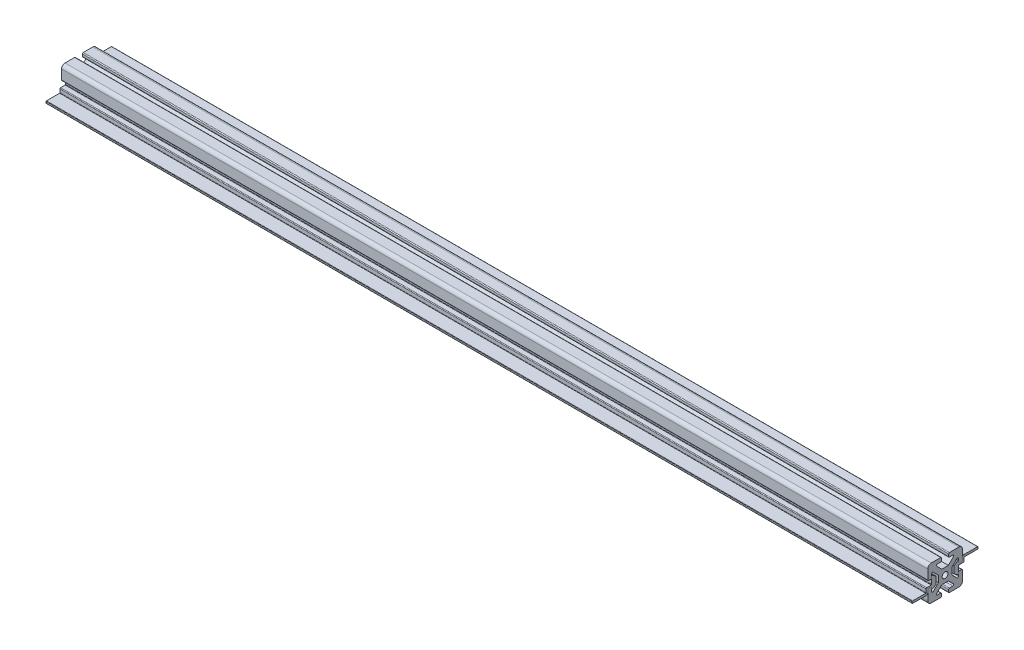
from build123d import *

# Parameters (mm, degrees)
STRUKTURBAUTEIL1_DEPTH = 1000
MODEL3_R               = 3.4
STRUKTURBAUTEIL3_DEPTH = 1000
STRUKTURBAUTEIL4_DEPTH = 1000


with BuildPart() as part:
    # Model → Strukturbauteil1 (new body)
    with BuildSketch(Plane(origin=(0, 0, 0), x_dir=(0, -1, 0), z_dir=(1, 0, 0))):
        with BuildLine():
            Line((-4, -5), (4, -5))
            ThreePointArc((4, -5), (4.126912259, -4.971833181), (4.229993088, -4.892621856))
            Line((4.229993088, -4.892621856), (4.52990526, -4.523514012))
            Line((4.52990526, -4.523514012), (4.818714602, -4.145655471))
            Line((4.818714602, -4.145655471), (5.096165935, -3.759380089))
            Line((5.096165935, -3.759380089), (5.362014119, -3.36502916))
            Line((5.362014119, -3.36502916), (5.616024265, -2.96295111))
            Line((5.616024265, -2.96295111), (5.857971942, -2.553501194))
            Line((5.857971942, -2.553501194), (6.08764338, -2.13704118))
            Line((6.08764338, -2.13704118), (6.304835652, -1.71393903))
            Line((6.304835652, -1.71393903), (6.509356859, -1.284568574))
            Line((6.509356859, -1.284568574), (6.701026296, -0.849309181))
            Line((6.701026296, -0.849309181), (6.879674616, -0.408545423))
            ThreePointArc((6.879674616, -0.408545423), (6.847551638, -0.130535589), (6.6, 0))
            Line((6.6, 0), (-1.6, 0))
            ThreePointArc((-1.6, 0), (-1.953553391, 0.146446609), (-2.1, 0.5))
            Line((-2.1, 0.5), (-2.1, 5.7))
            ThreePointArc((-2.1, 5.7), (-2.334314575, 6.265685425), (-2.9, 6.5))
            Line((-2.9, 6.5), (-6.8, 6.5))
            ThreePointArc((-6.8, 6.5), (-7.012132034, 6.587867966), (-7.1, 6.8))
            Line((-7.1, 6.8), (-7.1, 22))
            ThreePointArc((-7.1, 22), (-7.246446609, 22.353553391), (-7.6, 22.5))
            Line((-7.6, 22.5), (-9.1, 22.5))
            ThreePointArc((-9.1, 22.5), (-9.453553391, 22.353553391), (-9.6, 22))
            Line((-9.6, 22), (-9.6, 6.5))
            ThreePointArc((-9.6, 6.5), (-9.014213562, 5.085786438), (-7.6, 4.5))
            Line((-7.6, 4.5), (-5.6, 4.5))
            ThreePointArc((-5.6, 4.5), (-4.539339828, 4.060660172), (-4.1, 3))
            Line((-4.1, 3), (-4.1, 1))
            ThreePointArc((-4.1, 1), (-4.392893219, 0.292893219), (-5.1, 0))
            Line((-5.1, 0), (-6.6, 0))
            ThreePointArc((-6.6, 0), (-6.847551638, -0.130535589), (-6.879674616, -0.408545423))
            Line((-6.879674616, -0.408545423), (-6.701026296, -0.849309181))
            Line((-6.701026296, -0.849309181), (-6.509356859, -1.284568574))
            Line((-6.509356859, -1.284568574), (-6.304835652, -1.71393903))
            Line((-6.304835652, -1.71393903), (-6.08764338, -2.13704118))
            Line((-6.08764338, -2.13704118), (-5.857971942, -2.553501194))
            Line((-5.857971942, -2.553501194), (-5.616024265, -2.96295111))
            Line((-5.616024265, -2.96295111), (-5.362014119, -3.36502916))
            Line((-5.362014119, -3.36502916), (-5.096165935, -3.759380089))
            Line((-5.096165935, -3.759380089), (-4.818714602, -4.145655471))
            Line((-4.818714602, -4.145655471), (-4.52990526, -4.523514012))
            Line((-4.52990526, -4.523514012), (-4.229993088, -4.892621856))
            ThreePointArc((-4.229993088, -4.892621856), (-4.126912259, -4.971833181), (-4, -5))
        make_face()
    extrude(amount=STRUKTURBAUTEIL1_DEPTH)


with BuildPart() as body_2:
    # Model3 → Strukturbauteil3 (new body)
    with BuildSketch(Plane(origin=(0, 0, 15.5), x_dir=(0, 0, -1), z_dir=(1, 0, 0))):
        with BuildLine():
            Line((-18.5, -4), (-16.5, -4))
            ThreePointArc((-16.5, -4), (-15.792893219, -4.292893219), (-15.5, -5))
            Line((-15.5, -5), (-15.5, -8.91611505))
            ThreePointArc((-15.5, -8.91611505), (-14.905025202, -9.883468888), (-13.773297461, -9.788807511))
            Line((-13.773297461, -9.788807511), (-7.75, -3.793502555))
            Line((-7.75, -3.793502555), (-7.75, 3.793502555))
            Line((-7.75, 3.793502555), (-13.773297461, 9.788807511))
            ThreePointArc((-13.773297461, 9.788807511), (-14.905025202, 9.883468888), (-15.5, 8.91611505))
            Line((-15.5, 8.91611505), (-15.5, 5))
            ThreePointArc((-15.5, 5), (-15.792893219, 4.292893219), (-16.5, 4))
            Line((-16.5, 4), (-18.5, 4))
            Line((-18.5, 4), (-19, 4))
            ThreePointArc((-19, 4), (-19.707106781, 4.292893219), (-20, 5))
            Line((-20, 5), (-20, 16))
            ThreePointArc((-20, 16), (-18.828427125, 18.828427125), (-16, 20))
            Line((-16, 20), (-5.5, 20))
            Line((-5.5, 20), (-5, 20))
            ThreePointArc((-5, 20), (-4.292893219, 19.707106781), (-4, 19))
            Line((-4, 19), (-4, 18.5))
            Line((-4, 18.5), (-4, 16.5))
            ThreePointArc((-4, 16.5), (-4.292893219, 15.792893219), (-5, 15.5))
            Line((-5, 15.5), (-8.91611505, 15.5))
            ThreePointArc((-8.91611505, 15.5), (-9.883468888, 14.905025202), (-9.788807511, 13.773297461))
            Line((-9.788807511, 13.773297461), (-3.793502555, 7.75))
            Line((-3.793502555, 7.75), (3.793502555, 7.75))
            Line((3.793502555, 7.75), (9.788807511, 13.773297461))
            ThreePointArc((9.788807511, 13.773297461), (9.883468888, 14.905025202), (8.91611505, 15.5))
            Line((8.91611505, 15.5), (5, 15.5))
            ThreePointArc((5, 15.5), (4.292893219, 15.792893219), (4, 16.5))
            Line((4, 16.5), (4, 18.5))
            Line((4, 18.5), (4, 19))
            ThreePointArc((4, 19), (4.292893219, 19.707106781), (5, 20))
            Line((5, 20), (5.5, 20))
            Line((5.5, 20), (16, 20))
            ThreePointArc((16, 20), (18.828427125, 18.828427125), (20, 16))
            Line((20, 16), (20, 5.5))
            Line((20, 5.5), (20, 5))
            ThreePointArc((20, 5), (19.707106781, 4.292893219), (19, 4))
            Line((19, 4), (18.5, 4))
            Line((18.5, 4), (16.5, 4))
            ThreePointArc((16.5, 4), (15.792893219, 4.292893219), (15.5, 5))
            Line((15.5, 5), (15.5, 8.91611505))
            ThreePointArc((15.5, 8.91611505), (14.905025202, 9.883468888), (13.773297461, 9.788807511))
            Line((13.773297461, 9.788807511), (7.75, 3.793502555))
            Line((7.75, 3.793502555), (7.75, -3.793502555))
            Line((7.75, -3.793502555), (13.773297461, -9.788807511))
            ThreePointArc((13.773297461, -9.788807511), (14.905025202, -9.883468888), (15.5, -8.91611505))
            Line((15.5, -8.91611505), (15.5, -5))
            ThreePointArc((15.5, -5), (15.792893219, -4.292893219), (16.5, -4))
            Line((16.5, -4), (18.5, -4))
            Line((18.5, -4), (19, -4))
            ThreePointArc((19, -4), (19.707106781, -4.292893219), (20, -5))
            Line((20, -5), (20, -5.5))
            Line((20, -5.5), (20, -16))
            ThreePointArc((20, -16), (18.828427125, -18.828427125), (16, -20))
            Line((16, -20), (5.5, -20))
            Line((5.5, -20), (5, -20))
            ThreePointArc((5, -20), (4.292893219, -19.707106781), (4, -19))
            Line((4, -19), (4, -18.5))
            Line((4, -18.5), (4, -16.5))
            ThreePointArc((4, -16.5), (4.292893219, -15.792893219), (5, -15.5))
            Line((5, -15.5), (8.91611505, -15.5))
            ThreePointArc((8.91611505, -15.5), (9.883468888, -14.905025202), (9.788807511, -13.773297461))
            Line((9.788807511, -13.773297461), (3.793502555, -7.75))
            Line((3.793502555, -7.75), (-3.793502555, -7.75))
            Line((-3.793502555, -7.75), (-9.788807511, -13.773297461))
            ThreePointArc((-9.788807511, -13.773297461), (-9.883468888, -14.905025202), (-8.91611505, -15.5))
            Line((-8.91611505, -15.5), (-5, -15.5))
            ThreePointArc((-5, -15.5), (-4.292893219, -15.792893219), (-4, -16.5))
            Line((-4, -16.5), (-4, -18.5))
            Line((-4, -18.5), (-4, -19))
            ThreePointArc((-4, -19), (-4.292893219, -19.707106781), (-5, -20))
            Line((-5, -20), (-5.5, -20))
            Line((-5.5, -20), (-16, -20))
            ThreePointArc((-16, -20), (-18.828427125, -18.828427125), (-20, -16))
            Line((-20, -16), (-20, -5))
            ThreePointArc((-20, -5), (-19.707106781, -4.292893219), (-19, -4))
            Line((-19, -4), (-18.5, -4))
        make_face()
        Circle(MODEL3_R, mode=Mode.SUBTRACT)
    extrude(amount=STRUKTURBAUTEIL3_DEPTH)


with BuildPart() as body_3:
    # Model4 → Strukturbauteil4 (new body)
    with BuildSketch(Plane(origin=(0, 0, 31), x_dir=(0, 1, 0), z_dir=(1, 0, 0))):
        with BuildLine():
            Line((-4, -5), (4, -5))
            ThreePointArc((4, -5), (4.126912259, -4.971833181), (4.229993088, -4.892621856))
            Line((4.229993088, -4.892621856), (4.52990526, -4.523514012))
            Line((4.52990526, -4.523514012), (4.818714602, -4.145655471))
            Line((4.818714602, -4.145655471), (5.096165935, -3.759380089))
            Line((5.096165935, -3.759380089), (5.362014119, -3.36502916))
            Line((5.362014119, -3.36502916), (5.616024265, -2.96295111))
            Line((5.616024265, -2.96295111), (5.857971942, -2.553501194))
            Line((5.857971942, -2.553501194), (6.08764338, -2.13704118))
            Line((6.08764338, -2.13704118), (6.304835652, -1.71393903))
            Line((6.304835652, -1.71393903), (6.509356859, -1.284568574))
            Line((6.509356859, -1.284568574), (6.701026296, -0.849309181))
            Line((6.701026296, -0.849309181), (6.879674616, -0.408545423))
            ThreePointArc((6.879674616, -0.408545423), (6.847551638, -0.130535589), (6.6, 0))
            Line((6.6, 0), (-1.6, 0))
            ThreePointArc((-1.6, 0), (-1.953553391, 0.146446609), (-2.1, 0.5))
            Line((-2.1, 0.5), (-2.1, 5.7))
            ThreePointArc((-2.1, 5.7), (-2.334314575, 6.265685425), (-2.9, 6.5))
            Line((-2.9, 6.5), (-6.8, 6.5))
            ThreePointArc((-6.8, 6.5), (-7.012132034, 6.587867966), (-7.1, 6.8))
            Line((-7.1, 6.8), (-7.1, 22))
            ThreePointArc((-7.1, 22), (-7.246446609, 22.353553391), (-7.6, 22.5))
            Line((-7.6, 22.5), (-9.1, 22.5))
            ThreePointArc((-9.1, 22.5), (-9.453553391, 22.353553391), (-9.6, 22))
            Line((-9.6, 22), (-9.6, 6.5))
            ThreePointArc((-9.6, 6.5), (-9.014213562, 5.085786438), (-7.6, 4.5))
            Line((-7.6, 4.5), (-5.6, 4.5))
            ThreePointArc((-5.6, 4.5), (-4.539339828, 4.060660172), (-4.1, 3))
            Line((-4.1, 3), (-4.1, 1))
            ThreePointArc((-4.1, 1), (-4.392893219, 0.292893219), (-5.1, 0))
            Line((-5.1, 0), (-6.6, 0))
            ThreePointArc((-6.6, 0), (-6.847551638, -0.130535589), (-6.879674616, -0.408545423))
            Line((-6.879674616, -0.408545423), (-6.701026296, -0.849309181))
            Line((-6.701026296, -0.849309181), (-6.509356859, -1.284568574))
            Line((-6.509356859, -1.284568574), (-6.304835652, -1.71393903))
            Line((-6.304835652, -1.71393903), (-6.08764338, -2.13704118))
            Line((-6.08764338, -2.13704118), (-5.857971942, -2.553501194))
            Line((-5.857971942, -2.553501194), (-5.616024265, -2.96295111))
            Line((-5.616024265, -2.96295111), (-5.362014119, -3.36502916))
            Line((-5.362014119, -3.36502916), (-5.096165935, -3.759380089))
            Line((-5.096165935, -3.759380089), (-4.818714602, -4.145655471))
            Line((-4.818714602, -4.145655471), (-4.52990526, -4.523514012))
            Line((-4.52990526, -4.523514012), (-4.229993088, -4.892621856))
            ThreePointArc((-4.229993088, -4.892621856), (-4.126912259, -4.971833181), (-4, -5))
        make_face()
    extrude(amount=STRUKTURBAUTEIL4_DEPTH)


solid = Compound([part.part, body_2.part, body_3.part])
